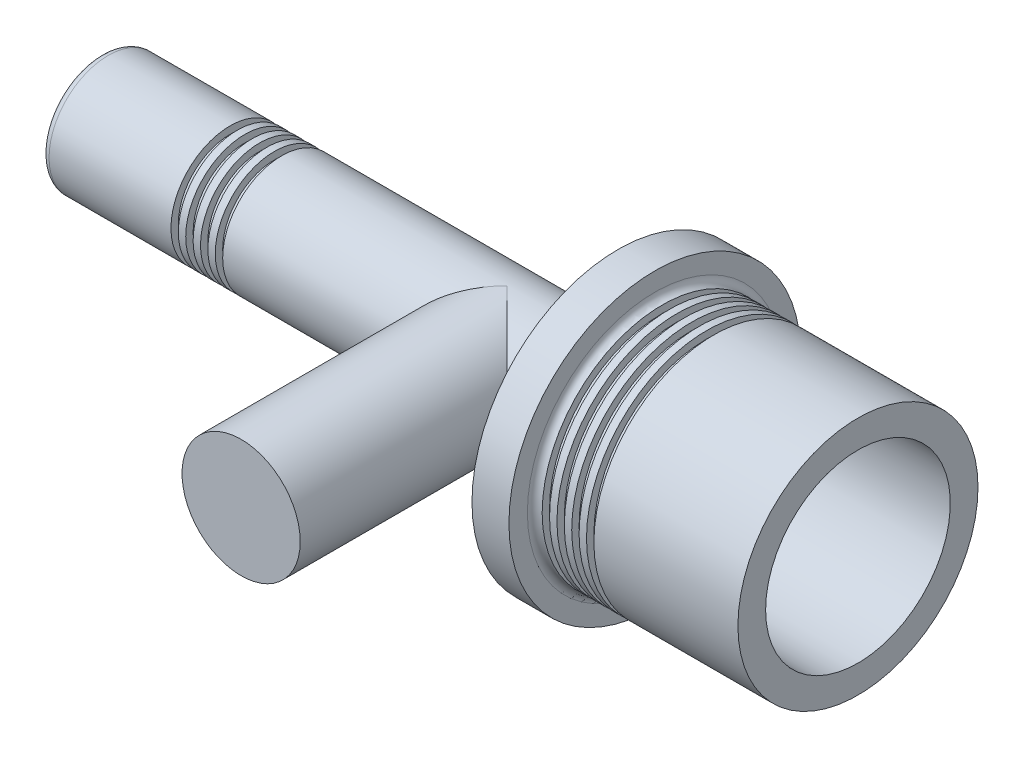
ISO-10303-21;
HEADER;
FILE_DESCRIPTION(('STEP AP214'),'2;1');
FILE_NAME('part.step','',(''),(''),'','','');
FILE_SCHEMA(('AUTOMOTIVE_DESIGN { 1 0 10303 214 1 1 1 1 }'));
ENDSEC;
DATA;
#1=APPLICATION_CONTEXT('core data for automotive mechanical design processes');
#2=APPLICATION_PROTOCOL_DEFINITION('international standard','automotive_design',2000,#1);
#3=PRODUCT_CONTEXT('',#1,'mechanical');
#4=PRODUCT('Part','Part','',(#3));
#5=PRODUCT_RELATED_PRODUCT_CATEGORY('part','',(#4));
#6=PRODUCT_DEFINITION_FORMATION('','',#4);
#7=PRODUCT_DEFINITION_CONTEXT('part definition',#1,'design');
#8=PRODUCT_DEFINITION('design','',#6,#7);
#9=PRODUCT_DEFINITION_SHAPE('','',#8);
#10=(LENGTH_UNIT() NAMED_UNIT(*) SI_UNIT(.MILLI.,.METRE.));
#11=(NAMED_UNIT(*) PLANE_ANGLE_UNIT() SI_UNIT($,.RADIAN.));
#12=(NAMED_UNIT(*) SI_UNIT($,.STERADIAN.) SOLID_ANGLE_UNIT());
#13=UNCERTAINTY_MEASURE_WITH_UNIT(LENGTH_MEASURE(1.E-05),#10,'distance_accuracy_value','');
#14=(GEOMETRIC_REPRESENTATION_CONTEXT(3) GLOBAL_UNCERTAINTY_ASSIGNED_CONTEXT((#13)) GLOBAL_UNIT_ASSIGNED_CONTEXT((#10,
#11,#12)) REPRESENTATION_CONTEXT('',''));
#15=CARTESIAN_POINT('',(0.,0.,0.));
#16=DIRECTION('',(0.,0.,1.));
#17=DIRECTION('',(1.,0.,0.));
#18=AXIS2_PLACEMENT_3D('',#15,#16,#17);
#19=CARTESIAN_POINT('',(0.,0.,0.));
#20=DIRECTION('',(-1.,0.,0.));
#21=DIRECTION('',(0.,0.,1.));
#22=AXIS2_PLACEMENT_3D('',#19,#20,#21);
#23=CYLINDRICAL_SURFACE('',#22,1.6);
#24=CARTESIAN_POINT('',(14.0001,0.,0.));
#25=DIRECTION('',(-1.,0.,0.));
#26=DIRECTION('',(0.,0.,1.));
#27=AXIS2_PLACEMENT_3D('',#24,#25,#26);
#28=CIRCLE('',#27,1.6);
#29=CARTESIAN_POINT('',(14.0001,0.,1.6));
#30=VERTEX_POINT('',#29);
#31=EDGE_CURVE('E195',#30,#30,#28,.T.);
#32=ORIENTED_EDGE('',*,*,#31,.T.);
#33=EDGE_LOOP('',(#32));
#34=FACE_BOUND('',#33,.T.);
#35=CARTESIAN_POINT('',(4.9001,0.,0.));
#36=DIRECTION('',(-1.,0.,0.));
#37=DIRECTION('',(0.,0.,1.));
#38=AXIS2_PLACEMENT_3D('',#35,#36,#37);
#39=CIRCLE('',#38,1.6);
#40=CARTESIAN_POINT('',(4.9001,0.,1.6));
#41=VERTEX_POINT('',#40);
#42=EDGE_CURVE('E192',#41,#41,#39,.T.);
#43=ORIENTED_EDGE('',*,*,#42,.F.);
#44=EDGE_LOOP('',(#43));
#45=FACE_BOUND('',#44,.T.);
#46=CARTESIAN_POINT('',(11.0001,0.,0.));
#47=DIRECTION('',(-0.707106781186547,0.,-0.707106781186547));
#48=DIRECTION('',(-0.707106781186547,0.,0.707106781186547));
#49=AXIS2_PLACEMENT_3D('',#46,#47,#48);
#50=ELLIPSE('',#49,2.26274169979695,1.6);
#51=CARTESIAN_POINT('',(11.0001,1.6,0.));
#52=VERTEX_POINT('',#51);
#53=CARTESIAN_POINT('',(11.0001,-1.6,0.));
#54=VERTEX_POINT('',#53);
#55=EDGE_CURVE('E42',#52,#54,#50,.F.);
#56=ORIENTED_EDGE('',*,*,#55,.F.);
#57=CARTESIAN_POINT('',(11.0001,0.,0.));
#58=DIRECTION('',(-0.707106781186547,0.,0.707106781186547));
#59=DIRECTION('',(-0.707106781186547,0.,-0.707106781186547));
#60=AXIS2_PLACEMENT_3D('',#57,#58,#59);
#61=ELLIPSE('',#60,2.26274169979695,1.6);
#62=EDGE_CURVE('E40',#54,#52,#61,.T.);
#63=ORIENTED_EDGE('',*,*,#62,.F.);
#64=EDGE_LOOP('',(#56,#63));
#65=FACE_BOUND('',#64,.T.);
#66=ADVANCED_FACE('F26',(#34,#45,#65),#23,.T.);
#67=CARTESIAN_POINT('',(9.99999999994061E-05,0.,0.));
#68=DIRECTION('',(1.,0.,0.));
#69=DIRECTION('',(0.,0.,-1.));
#70=AXIS2_PLACEMENT_3D('',#67,#68,#69);
#71=PLANE('',#70);
#72=CARTESIAN_POINT('',(9.99999999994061E-05,0.,0.));
#73=DIRECTION('',(1.,0.,0.));
#74=DIRECTION('',(0.,0.,-1.));
#75=AXIS2_PLACEMENT_3D('',#72,#73,#74);
#76=CIRCLE('',#75,1.4);
#77=CARTESIAN_POINT('',(9.99999999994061E-05,0.,-1.4));
#78=VERTEX_POINT('',#77);
#79=EDGE_CURVE('E44',#78,#78,#76,.F.);
#80=ORIENTED_EDGE('',*,*,#79,.T.);
#81=EDGE_LOOP('',(#80));
#82=FACE_BOUND('',#81,.T.);
#83=ADVANCED_FACE('F28',(#82),#71,.F.);
#84=CARTESIAN_POINT('',(0.,0.,0.));
#85=DIRECTION('',(-1.,0.,0.));
#86=DIRECTION('',(0.,0.,1.));
#87=AXIS2_PLACEMENT_3D('',#84,#85,#86);
#88=CYLINDRICAL_SURFACE('',#87,1.6);
#89=CARTESIAN_POINT('',(0.200099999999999,0.,0.));
#90=DIRECTION('',(1.,0.,0.));
#91=DIRECTION('',(0.,0.,-1.));
#92=AXIS2_PLACEMENT_3D('',#89,#90,#91);
#93=CIRCLE('',#92,1.6);
#94=CARTESIAN_POINT('',(0.200099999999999,0.,-1.6));
#95=VERTEX_POINT('',#94);
#96=EDGE_CURVE('E34',#95,#95,#93,.T.);
#97=ORIENTED_EDGE('',*,*,#96,.T.);
#98=EDGE_LOOP('',(#97));
#99=FACE_BOUND('',#98,.T.);
#100=CARTESIAN_POINT('',(3.5001,0.,0.));
#101=DIRECTION('',(-1.,0.,0.));
#102=DIRECTION('',(0.,0.,1.));
#103=AXIS2_PLACEMENT_3D('',#100,#101,#102);
#104=CIRCLE('',#103,1.6);
#105=CARTESIAN_POINT('',(3.5001,0.,1.6));
#106=VERTEX_POINT('',#105);
#107=EDGE_CURVE('E47',#106,#106,#104,.T.);
#108=ORIENTED_EDGE('',*,*,#107,.T.);
#109=EDGE_LOOP('',(#108));
#110=FACE_BOUND('',#109,.T.);
#111=ADVANCED_FACE('F58',(#99,#110),#88,.T.);
#112=CARTESIAN_POINT('',(3.5001,1.6,0.));
#113=DIRECTION('',(-1.,0.,0.));
#114=DIRECTION('',(0.,0.,1.));
#115=AXIS2_PLACEMENT_3D('',#112,#113,#114);
#116=PLANE('',#115);
#117=ORIENTED_EDGE('',*,*,#107,.F.);
#118=EDGE_LOOP('',(#117));
#119=FACE_BOUND('',#118,.T.);
#120=CARTESIAN_POINT('',(3.5001,0.,0.));
#121=DIRECTION('',(-1.,0.,0.));
#122=DIRECTION('',(0.,0.,1.));
#123=AXIS2_PLACEMENT_3D('',#120,#121,#122);
#124=CIRCLE('',#123,1.4);
#125=CARTESIAN_POINT('',(3.5001,0.,1.4));
#126=VERTEX_POINT('',#125);
#127=EDGE_CURVE('E50',#126,#126,#124,.T.);
#128=ORIENTED_EDGE('',*,*,#127,.T.);
#129=EDGE_LOOP('',(#128));
#130=FACE_BOUND('',#129,.T.);
#131=ADVANCED_FACE('F74',(#119,#130),#116,.F.);
#132=CARTESIAN_POINT('',(0.,0.,0.));
#133=DIRECTION('',(-1.,0.,0.));
#134=DIRECTION('',(0.,0.,1.));
#135=AXIS2_PLACEMENT_3D('',#132,#133,#134);
#136=CYLINDRICAL_SURFACE('',#135,1.4);
#137=ORIENTED_EDGE('',*,*,#127,.F.);
#138=EDGE_LOOP('',(#137));
#139=FACE_BOUND('',#138,.T.);
#140=CARTESIAN_POINT('',(3.7001,0.,0.));
#141=DIRECTION('',(-1.,0.,0.));
#142=DIRECTION('',(0.,0.,1.));
#143=AXIS2_PLACEMENT_3D('',#140,#141,#142);
#144=CIRCLE('',#143,1.4);
#145=CARTESIAN_POINT('',(3.7001,0.,1.4));
#146=VERTEX_POINT('',#145);
#147=EDGE_CURVE('E152',#146,#146,#144,.T.);
#148=ORIENTED_EDGE('',*,*,#147,.T.);
#149=EDGE_LOOP('',(#148));
#150=FACE_BOUND('',#149,.T.);
#151=ADVANCED_FACE('F139',(#139,#150),#136,.T.);
#152=CARTESIAN_POINT('',(3.7001,1.4,0.));
#153=DIRECTION('',(1.,0.,0.));
#154=DIRECTION('',(0.,0.,-1.));
#155=AXIS2_PLACEMENT_3D('',#152,#153,#154);
#156=PLANE('',#155);
#157=ORIENTED_EDGE('',*,*,#147,.F.);
#158=EDGE_LOOP('',(#157));
#159=FACE_BOUND('',#158,.T.);
#160=CARTESIAN_POINT('',(3.7001,0.,0.));
#161=DIRECTION('',(-1.,0.,0.));
#162=DIRECTION('',(0.,0.,1.));
#163=AXIS2_PLACEMENT_3D('',#160,#161,#162);
#164=CIRCLE('',#163,1.6);
#165=CARTESIAN_POINT('',(3.7001,0.,1.6));
#166=VERTEX_POINT('',#165);
#167=EDGE_CURVE('E154',#166,#166,#164,.T.);
#168=ORIENTED_EDGE('',*,*,#167,.T.);
#169=EDGE_LOOP('',(#168));
#170=FACE_BOUND('',#169,.T.);
#171=ADVANCED_FACE('F135',(#159,#170),#156,.F.);
#172=CARTESIAN_POINT('',(0.,0.,0.));
#173=DIRECTION('',(-1.,0.,0.));
#174=DIRECTION('',(0.,0.,1.));
#175=AXIS2_PLACEMENT_3D('',#172,#173,#174);
#176=CYLINDRICAL_SURFACE('',#175,1.6);
#177=ORIENTED_EDGE('',*,*,#167,.F.);
#178=EDGE_LOOP('',(#177));
#179=FACE_BOUND('',#178,.T.);
#180=CARTESIAN_POINT('',(3.9001,0.,0.));
#181=DIRECTION('',(-1.,0.,0.));
#182=DIRECTION('',(0.,0.,1.));
#183=AXIS2_PLACEMENT_3D('',#180,#181,#182);
#184=CIRCLE('',#183,1.6);
#185=CARTESIAN_POINT('',(3.9001,0.,1.6));
#186=VERTEX_POINT('',#185);
#187=EDGE_CURVE('E159',#186,#186,#184,.T.);
#188=ORIENTED_EDGE('',*,*,#187,.T.);
#189=EDGE_LOOP('',(#188));
#190=FACE_BOUND('',#189,.T.);
#191=ADVANCED_FACE('F131',(#179,#190),#176,.T.);
#192=CARTESIAN_POINT('',(3.9001,1.6,0.));
#193=DIRECTION('',(-1.,0.,0.));
#194=DIRECTION('',(0.,0.,1.));
#195=AXIS2_PLACEMENT_3D('',#192,#193,#194);
#196=PLANE('',#195);
#197=ORIENTED_EDGE('',*,*,#187,.F.);
#198=EDGE_LOOP('',(#197));
#199=FACE_BOUND('',#198,.T.);
#200=CARTESIAN_POINT('',(3.9001,0.,0.));
#201=DIRECTION('',(-1.,0.,0.));
#202=DIRECTION('',(0.,0.,1.));
#203=AXIS2_PLACEMENT_3D('',#200,#201,#202);
#204=CIRCLE('',#203,1.4);
#205=CARTESIAN_POINT('',(3.9001,0.,1.4));
#206=VERTEX_POINT('',#205);
#207=EDGE_CURVE('E162',#206,#206,#204,.T.);
#208=ORIENTED_EDGE('',*,*,#207,.T.);
#209=EDGE_LOOP('',(#208));
#210=FACE_BOUND('',#209,.T.);
#211=ADVANCED_FACE('F127',(#199,#210),#196,.F.);
#212=CARTESIAN_POINT('',(0.,0.,0.));
#213=DIRECTION('',(-1.,0.,0.));
#214=DIRECTION('',(0.,0.,1.));
#215=AXIS2_PLACEMENT_3D('',#212,#213,#214);
#216=CYLINDRICAL_SURFACE('',#215,1.4);
#217=ORIENTED_EDGE('',*,*,#207,.F.);
#218=EDGE_LOOP('',(#217));
#219=FACE_BOUND('',#218,.T.);
#220=CARTESIAN_POINT('',(4.1001,0.,0.));
#221=DIRECTION('',(-1.,0.,0.));
#222=DIRECTION('',(0.,0.,1.));
#223=AXIS2_PLACEMENT_3D('',#220,#221,#222);
#224=CIRCLE('',#223,1.4);
#225=CARTESIAN_POINT('',(4.1001,0.,1.4));
#226=VERTEX_POINT('',#225);
#227=EDGE_CURVE('E165',#226,#226,#224,.T.);
#228=ORIENTED_EDGE('',*,*,#227,.T.);
#229=EDGE_LOOP('',(#228));
#230=FACE_BOUND('',#229,.T.);
#231=ADVANCED_FACE('F123',(#219,#230),#216,.T.);
#232=CARTESIAN_POINT('',(4.1001,1.4,0.));
#233=DIRECTION('',(1.,0.,0.));
#234=DIRECTION('',(0.,0.,-1.));
#235=AXIS2_PLACEMENT_3D('',#232,#233,#234);
#236=PLANE('',#235);
#237=ORIENTED_EDGE('',*,*,#227,.F.);
#238=EDGE_LOOP('',(#237));
#239=FACE_BOUND('',#238,.T.);
#240=CARTESIAN_POINT('',(4.1001,0.,0.));
#241=DIRECTION('',(-1.,0.,0.));
#242=DIRECTION('',(0.,0.,1.));
#243=AXIS2_PLACEMENT_3D('',#240,#241,#242);
#244=CIRCLE('',#243,1.6);
#245=CARTESIAN_POINT('',(4.1001,0.,1.6));
#246=VERTEX_POINT('',#245);
#247=EDGE_CURVE('E168',#246,#246,#244,.T.);
#248=ORIENTED_EDGE('',*,*,#247,.T.);
#249=EDGE_LOOP('',(#248));
#250=FACE_BOUND('',#249,.T.);
#251=ADVANCED_FACE('F119',(#239,#250),#236,.F.);
#252=CARTESIAN_POINT('',(0.,0.,0.));
#253=DIRECTION('',(-1.,0.,0.));
#254=DIRECTION('',(0.,0.,1.));
#255=AXIS2_PLACEMENT_3D('',#252,#253,#254);
#256=CYLINDRICAL_SURFACE('',#255,1.6);
#257=ORIENTED_EDGE('',*,*,#247,.F.);
#258=EDGE_LOOP('',(#257));
#259=FACE_BOUND('',#258,.T.);
#260=CARTESIAN_POINT('',(4.3001,0.,0.));
#261=DIRECTION('',(-1.,0.,0.));
#262=DIRECTION('',(0.,0.,1.));
#263=AXIS2_PLACEMENT_3D('',#260,#261,#262);
#264=CIRCLE('',#263,1.6);
#265=CARTESIAN_POINT('',(4.3001,0.,1.6));
#266=VERTEX_POINT('',#265);
#267=EDGE_CURVE('E171',#266,#266,#264,.T.);
#268=ORIENTED_EDGE('',*,*,#267,.T.);
#269=EDGE_LOOP('',(#268));
#270=FACE_BOUND('',#269,.T.);
#271=ADVANCED_FACE('F115',(#259,#270),#256,.T.);
#272=CARTESIAN_POINT('',(4.3001,1.6,0.));
#273=DIRECTION('',(-1.,0.,0.));
#274=DIRECTION('',(0.,0.,1.));
#275=AXIS2_PLACEMENT_3D('',#272,#273,#274);
#276=PLANE('',#275);
#277=ORIENTED_EDGE('',*,*,#267,.F.);
#278=EDGE_LOOP('',(#277));
#279=FACE_BOUND('',#278,.T.);
#280=CARTESIAN_POINT('',(4.3001,0.,0.));
#281=DIRECTION('',(-1.,0.,0.));
#282=DIRECTION('',(0.,0.,1.));
#283=AXIS2_PLACEMENT_3D('',#280,#281,#282);
#284=CIRCLE('',#283,1.4);
#285=CARTESIAN_POINT('',(4.3001,0.,1.4));
#286=VERTEX_POINT('',#285);
#287=EDGE_CURVE('E174',#286,#286,#284,.T.);
#288=ORIENTED_EDGE('',*,*,#287,.T.);
#289=EDGE_LOOP('',(#288));
#290=FACE_BOUND('',#289,.T.);
#291=ADVANCED_FACE('F111',(#279,#290),#276,.F.);
#292=CARTESIAN_POINT('',(0.,0.,0.));
#293=DIRECTION('',(-1.,0.,0.));
#294=DIRECTION('',(0.,0.,1.));
#295=AXIS2_PLACEMENT_3D('',#292,#293,#294);
#296=CYLINDRICAL_SURFACE('',#295,1.4);
#297=ORIENTED_EDGE('',*,*,#287,.F.);
#298=EDGE_LOOP('',(#297));
#299=FACE_BOUND('',#298,.T.);
#300=CARTESIAN_POINT('',(4.5001,0.,0.));
#301=DIRECTION('',(-1.,0.,0.));
#302=DIRECTION('',(0.,0.,1.));
#303=AXIS2_PLACEMENT_3D('',#300,#301,#302);
#304=CIRCLE('',#303,1.4);
#305=CARTESIAN_POINT('',(4.5001,0.,1.4));
#306=VERTEX_POINT('',#305);
#307=EDGE_CURVE('E177',#306,#306,#304,.T.);
#308=ORIENTED_EDGE('',*,*,#307,.T.);
#309=EDGE_LOOP('',(#308));
#310=FACE_BOUND('',#309,.T.);
#311=ADVANCED_FACE('F107',(#299,#310),#296,.T.);
#312=CARTESIAN_POINT('',(4.5001,1.6,0.));
#313=DIRECTION('',(1.,0.,0.));
#314=DIRECTION('',(0.,0.,-1.));
#315=AXIS2_PLACEMENT_3D('',#312,#313,#314);
#316=PLANE('',#315);
#317=ORIENTED_EDGE('',*,*,#307,.F.);
#318=EDGE_LOOP('',(#317));
#319=FACE_BOUND('',#318,.T.);
#320=CARTESIAN_POINT('',(4.5001,0.,0.));
#321=DIRECTION('',(-1.,0.,0.));
#322=DIRECTION('',(0.,0.,1.));
#323=AXIS2_PLACEMENT_3D('',#320,#321,#322);
#324=CIRCLE('',#323,1.6);
#325=CARTESIAN_POINT('',(4.5001,0.,1.6));
#326=VERTEX_POINT('',#325);
#327=EDGE_CURVE('E180',#326,#326,#324,.T.);
#328=ORIENTED_EDGE('',*,*,#327,.T.);
#329=EDGE_LOOP('',(#328));
#330=FACE_BOUND('',#329,.T.);
#331=ADVANCED_FACE('F103',(#319,#330),#316,.F.);
#332=CARTESIAN_POINT('',(0.,0.,0.));
#333=DIRECTION('',(-1.,0.,0.));
#334=DIRECTION('',(0.,0.,1.));
#335=AXIS2_PLACEMENT_3D('',#332,#333,#334);
#336=CYLINDRICAL_SURFACE('',#335,1.6);
#337=ORIENTED_EDGE('',*,*,#327,.F.);
#338=EDGE_LOOP('',(#337));
#339=FACE_BOUND('',#338,.T.);
#340=CARTESIAN_POINT('',(4.7001,0.,0.));
#341=DIRECTION('',(-1.,0.,0.));
#342=DIRECTION('',(0.,0.,1.));
#343=AXIS2_PLACEMENT_3D('',#340,#341,#342);
#344=CIRCLE('',#343,1.6);
#345=CARTESIAN_POINT('',(4.7001,0.,1.6));
#346=VERTEX_POINT('',#345);
#347=EDGE_CURVE('E183',#346,#346,#344,.T.);
#348=ORIENTED_EDGE('',*,*,#347,.T.);
#349=EDGE_LOOP('',(#348));
#350=FACE_BOUND('',#349,.T.);
#351=ADVANCED_FACE('F99',(#339,#350),#336,.T.);
#352=CARTESIAN_POINT('',(4.7001,1.6,0.));
#353=DIRECTION('',(-1.,0.,0.));
#354=DIRECTION('',(0.,0.,1.));
#355=AXIS2_PLACEMENT_3D('',#352,#353,#354);
#356=PLANE('',#355);
#357=ORIENTED_EDGE('',*,*,#347,.F.);
#358=EDGE_LOOP('',(#357));
#359=FACE_BOUND('',#358,.T.);
#360=CARTESIAN_POINT('',(4.7001,0.,0.));
#361=DIRECTION('',(-1.,0.,0.));
#362=DIRECTION('',(0.,0.,1.));
#363=AXIS2_PLACEMENT_3D('',#360,#361,#362);
#364=CIRCLE('',#363,1.4);
#365=CARTESIAN_POINT('',(4.7001,0.,1.4));
#366=VERTEX_POINT('',#365);
#367=EDGE_CURVE('E186',#366,#366,#364,.T.);
#368=ORIENTED_EDGE('',*,*,#367,.T.);
#369=EDGE_LOOP('',(#368));
#370=FACE_BOUND('',#369,.T.);
#371=ADVANCED_FACE('F95',(#359,#370),#356,.F.);
#372=CARTESIAN_POINT('',(0.,0.,0.));
#373=DIRECTION('',(-1.,0.,0.));
#374=DIRECTION('',(0.,0.,1.));
#375=AXIS2_PLACEMENT_3D('',#372,#373,#374);
#376=CYLINDRICAL_SURFACE('',#375,1.4);
#377=ORIENTED_EDGE('',*,*,#367,.F.);
#378=EDGE_LOOP('',(#377));
#379=FACE_BOUND('',#378,.T.);
#380=CARTESIAN_POINT('',(4.9001,0.,0.));
#381=DIRECTION('',(-1.,0.,0.));
#382=DIRECTION('',(0.,0.,1.));
#383=AXIS2_PLACEMENT_3D('',#380,#381,#382);
#384=CIRCLE('',#383,1.4);
#385=CARTESIAN_POINT('',(4.9001,0.,1.4));
#386=VERTEX_POINT('',#385);
#387=EDGE_CURVE('E189',#386,#386,#384,.T.);
#388=ORIENTED_EDGE('',*,*,#387,.T.);
#389=EDGE_LOOP('',(#388));
#390=FACE_BOUND('',#389,.T.);
#391=ADVANCED_FACE('F91',(#379,#390),#376,.T.);
#392=CARTESIAN_POINT('',(4.9001,1.6,0.));
#393=DIRECTION('',(1.,0.,0.));
#394=DIRECTION('',(0.,0.,-1.));
#395=AXIS2_PLACEMENT_3D('',#392,#393,#394);
#396=PLANE('',#395);
#397=ORIENTED_EDGE('',*,*,#387,.F.);
#398=EDGE_LOOP('',(#397));
#399=FACE_BOUND('',#398,.T.);
#400=ORIENTED_EDGE('',*,*,#42,.T.);
#401=EDGE_LOOP('',(#400));
#402=FACE_BOUND('',#401,.T.);
#403=ADVANCED_FACE('F88',(#399,#402),#396,.F.);
#404=CARTESIAN_POINT('',(14.0001,1.6,0.));
#405=DIRECTION('',(1.,0.,0.));
#406=DIRECTION('',(0.,0.,-1.));
#407=AXIS2_PLACEMENT_3D('',#404,#405,#406);
#408=PLANE('',#407);
#409=ORIENTED_EDGE('',*,*,#31,.F.);
#410=EDGE_LOOP('',(#409));
#411=FACE_BOUND('',#410,.T.);
#412=CARTESIAN_POINT('',(14.0001,0.,0.));
#413=DIRECTION('',(-1.,0.,0.));
#414=DIRECTION('',(0.,0.,1.));
#415=AXIS2_PLACEMENT_3D('',#412,#413,#414);
#416=CIRCLE('',#415,3.95);
#417=CARTESIAN_POINT('',(14.0001,0.,3.95));
#418=VERTEX_POINT('',#417);
#419=EDGE_CURVE('E197',#418,#418,#416,.T.);
#420=ORIENTED_EDGE('',*,*,#419,.T.);
#421=EDGE_LOOP('',(#420));
#422=FACE_BOUND('',#421,.T.);
#423=ADVANCED_FACE('F86',(#411,#422),#408,.F.);
#424=CARTESIAN_POINT('',(0.,0.,0.));
#425=DIRECTION('',(-1.,0.,0.));
#426=DIRECTION('',(0.,0.,1.));
#427=AXIS2_PLACEMENT_3D('',#424,#425,#426);
#428=CYLINDRICAL_SURFACE('',#427,3.95);
#429=ORIENTED_EDGE('',*,*,#419,.F.);
#430=EDGE_LOOP('',(#429));
#431=FACE_BOUND('',#430,.T.);
#432=CARTESIAN_POINT('',(15.0001,0.,0.));
#433=DIRECTION('',(-1.,0.,0.));
#434=DIRECTION('',(0.,0.,1.));
#435=AXIS2_PLACEMENT_3D('',#432,#433,#434);
#436=CIRCLE('',#435,3.95);
#437=CARTESIAN_POINT('',(15.0001,0.,3.95));
#438=VERTEX_POINT('',#437);
#439=EDGE_CURVE('E200',#438,#438,#436,.T.);
#440=ORIENTED_EDGE('',*,*,#439,.T.);
#441=EDGE_LOOP('',(#440));
#442=FACE_BOUND('',#441,.T.);
#443=ADVANCED_FACE('F347',(#431,#442),#428,.T.);
#444=CARTESIAN_POINT('',(15.0001,3.95,0.));
#445=DIRECTION('',(-1.,0.,0.));
#446=DIRECTION('',(0.,0.,1.));
#447=AXIS2_PLACEMENT_3D('',#444,#445,#446);
#448=PLANE('',#447);
#449=CARTESIAN_POINT('',(15.0001,0.,0.));
#450=DIRECTION('',(-1.,0.,0.));
#451=DIRECTION('',(0.,0.,1.));
#452=AXIS2_PLACEMENT_3D('',#449,#450,#451);
#453=CIRCLE('',#452,3.45);
#454=CARTESIAN_POINT('',(15.0001,0.,3.45));
#455=VERTEX_POINT('',#454);
#456=EDGE_CURVE('E11',#455,#455,#453,.T.);
#457=ORIENTED_EDGE('',*,*,#456,.T.);
#458=EDGE_LOOP('',(#457));
#459=FACE_BOUND('',#458,.T.);
#460=ORIENTED_EDGE('',*,*,#439,.F.);
#461=EDGE_LOOP('',(#460));
#462=FACE_BOUND('',#461,.T.);
#463=ADVANCED_FACE('F344',(#459,#462),#448,.F.);
#464=CARTESIAN_POINT('',(15.2001,3.25,0.));
#465=DIRECTION('',(-1.,0.,0.));
#466=DIRECTION('',(0.,0.,1.));
#467=AXIS2_PLACEMENT_3D('',#464,#465,#466);
#468=PLANE('',#467);
#469=CARTESIAN_POINT('',(15.2001,0.,0.));
#470=DIRECTION('',(-1.,0.,0.));
#471=DIRECTION('',(0.,0.,1.));
#472=AXIS2_PLACEMENT_3D('',#469,#470,#471);
#473=CIRCLE('',#472,3.25);
#474=CARTESIAN_POINT('',(15.2001,0.,3.25));
#475=VERTEX_POINT('',#474);
#476=EDGE_CURVE('E203',#475,#475,#473,.T.);
#477=ORIENTED_EDGE('',*,*,#476,.F.);
#478=EDGE_LOOP('',(#477));
#479=FACE_BOUND('',#478,.T.);
#480=CARTESIAN_POINT('',(15.2001,0.,0.));
#481=DIRECTION('',(-1.,0.,0.));
#482=DIRECTION('',(0.,0.,1.));
#483=AXIS2_PLACEMENT_3D('',#480,#481,#482);
#484=CIRCLE('',#483,3.05);
#485=CARTESIAN_POINT('',(15.2001,0.,3.05));
#486=VERTEX_POINT('',#485);
#487=EDGE_CURVE('E206',#486,#486,#484,.T.);
#488=ORIENTED_EDGE('',*,*,#487,.T.);
#489=EDGE_LOOP('',(#488));
#490=FACE_BOUND('',#489,.T.);
#491=ADVANCED_FACE('F340',(#479,#490),#468,.F.);
#492=CARTESIAN_POINT('',(0.,0.,0.));
#493=DIRECTION('',(-1.,0.,0.));
#494=DIRECTION('',(0.,0.,1.));
#495=AXIS2_PLACEMENT_3D('',#492,#493,#494);
#496=CYLINDRICAL_SURFACE('',#495,3.05);
#497=ORIENTED_EDGE('',*,*,#487,.F.);
#498=EDGE_LOOP('',(#497));
#499=FACE_BOUND('',#498,.T.);
#500=CARTESIAN_POINT('',(15.4001,0.,0.));
#501=DIRECTION('',(-1.,0.,0.));
#502=DIRECTION('',(0.,0.,1.));
#503=AXIS2_PLACEMENT_3D('',#500,#501,#502);
#504=CIRCLE('',#503,3.05);
#505=CARTESIAN_POINT('',(15.4001,0.,3.05));
#506=VERTEX_POINT('',#505);
#507=EDGE_CURVE('E209',#506,#506,#504,.T.);
#508=ORIENTED_EDGE('',*,*,#507,.T.);
#509=EDGE_LOOP('',(#508));
#510=FACE_BOUND('',#509,.T.);
#511=ADVANCED_FACE('F336',(#499,#510),#496,.T.);
#512=CARTESIAN_POINT('',(15.4001,3.25,0.));
#513=DIRECTION('',(1.,0.,0.));
#514=DIRECTION('',(0.,0.,-1.));
#515=AXIS2_PLACEMENT_3D('',#512,#513,#514);
#516=PLANE('',#515);
#517=ORIENTED_EDGE('',*,*,#507,.F.);
#518=EDGE_LOOP('',(#517));
#519=FACE_BOUND('',#518,.T.);
#520=CARTESIAN_POINT('',(15.4001,0.,0.));
#521=DIRECTION('',(-1.,0.,0.));
#522=DIRECTION('',(0.,0.,1.));
#523=AXIS2_PLACEMENT_3D('',#520,#521,#522);
#524=CIRCLE('',#523,3.25);
#525=CARTESIAN_POINT('',(15.4001,0.,3.25));
#526=VERTEX_POINT('',#525);
#527=EDGE_CURVE('E212',#526,#526,#524,.T.);
#528=ORIENTED_EDGE('',*,*,#527,.T.);
#529=EDGE_LOOP('',(#528));
#530=FACE_BOUND('',#529,.T.);
#531=ADVANCED_FACE('F332',(#519,#530),#516,.F.);
#532=CARTESIAN_POINT('',(0.,0.,0.));
#533=DIRECTION('',(-1.,0.,0.));
#534=DIRECTION('',(0.,0.,1.));
#535=AXIS2_PLACEMENT_3D('',#532,#533,#534);
#536=CYLINDRICAL_SURFACE('',#535,3.25);
#537=ORIENTED_EDGE('',*,*,#527,.F.);
#538=EDGE_LOOP('',(#537));
#539=FACE_BOUND('',#538,.T.);
#540=CARTESIAN_POINT('',(15.6001,0.,0.));
#541=DIRECTION('',(-1.,0.,0.));
#542=DIRECTION('',(0.,0.,1.));
#543=AXIS2_PLACEMENT_3D('',#540,#541,#542);
#544=CIRCLE('',#543,3.25);
#545=CARTESIAN_POINT('',(15.6001,0.,3.25));
#546=VERTEX_POINT('',#545);
#547=EDGE_CURVE('E215',#546,#546,#544,.T.);
#548=ORIENTED_EDGE('',*,*,#547,.T.);
#549=EDGE_LOOP('',(#548));
#550=FACE_BOUND('',#549,.T.);
#551=ADVANCED_FACE('F328',(#539,#550),#536,.T.);
#552=CARTESIAN_POINT('',(15.6001,3.25,0.));
#553=DIRECTION('',(-1.,0.,0.));
#554=DIRECTION('',(0.,0.,1.));
#555=AXIS2_PLACEMENT_3D('',#552,#553,#554);
#556=PLANE('',#555);
#557=ORIENTED_EDGE('',*,*,#547,.F.);
#558=EDGE_LOOP('',(#557));
#559=FACE_BOUND('',#558,.T.);
#560=CARTESIAN_POINT('',(15.6001,0.,0.));
#561=DIRECTION('',(-1.,0.,0.));
#562=DIRECTION('',(0.,0.,1.));
#563=AXIS2_PLACEMENT_3D('',#560,#561,#562);
#564=CIRCLE('',#563,3.05);
#565=CARTESIAN_POINT('',(15.6001,0.,3.05));
#566=VERTEX_POINT('',#565);
#567=EDGE_CURVE('E218',#566,#566,#564,.T.);
#568=ORIENTED_EDGE('',*,*,#567,.T.);
#569=EDGE_LOOP('',(#568));
#570=FACE_BOUND('',#569,.T.);
#571=ADVANCED_FACE('F324',(#559,#570),#556,.F.);
#572=CARTESIAN_POINT('',(0.,0.,0.));
#573=DIRECTION('',(-1.,0.,0.));
#574=DIRECTION('',(0.,0.,1.));
#575=AXIS2_PLACEMENT_3D('',#572,#573,#574);
#576=CYLINDRICAL_SURFACE('',#575,3.05);
#577=ORIENTED_EDGE('',*,*,#567,.F.);
#578=EDGE_LOOP('',(#577));
#579=FACE_BOUND('',#578,.T.);
#580=CARTESIAN_POINT('',(15.8001,0.,0.));
#581=DIRECTION('',(-1.,0.,0.));
#582=DIRECTION('',(0.,0.,1.));
#583=AXIS2_PLACEMENT_3D('',#580,#581,#582);
#584=CIRCLE('',#583,3.05);
#585=CARTESIAN_POINT('',(15.8001,0.,3.05));
#586=VERTEX_POINT('',#585);
#587=EDGE_CURVE('E221',#586,#586,#584,.T.);
#588=ORIENTED_EDGE('',*,*,#587,.T.);
#589=EDGE_LOOP('',(#588));
#590=FACE_BOUND('',#589,.T.);
#591=ADVANCED_FACE('F320',(#579,#590),#576,.T.);
#592=CARTESIAN_POINT('',(15.8001,3.25,0.));
#593=DIRECTION('',(1.,0.,0.));
#594=DIRECTION('',(0.,0.,-1.));
#595=AXIS2_PLACEMENT_3D('',#592,#593,#594);
#596=PLANE('',#595);
#597=ORIENTED_EDGE('',*,*,#587,.F.);
#598=EDGE_LOOP('',(#597));
#599=FACE_BOUND('',#598,.T.);
#600=CARTESIAN_POINT('',(15.8001,0.,0.));
#601=DIRECTION('',(-1.,0.,0.));
#602=DIRECTION('',(0.,0.,1.));
#603=AXIS2_PLACEMENT_3D('',#600,#601,#602);
#604=CIRCLE('',#603,3.25);
#605=CARTESIAN_POINT('',(15.8001,0.,3.25));
#606=VERTEX_POINT('',#605);
#607=EDGE_CURVE('E224',#606,#606,#604,.T.);
#608=ORIENTED_EDGE('',*,*,#607,.T.);
#609=EDGE_LOOP('',(#608));
#610=FACE_BOUND('',#609,.T.);
#611=ADVANCED_FACE('F316',(#599,#610),#596,.F.);
#612=CARTESIAN_POINT('',(0.,0.,0.));
#613=DIRECTION('',(-1.,0.,0.));
#614=DIRECTION('',(0.,0.,1.));
#615=AXIS2_PLACEMENT_3D('',#612,#613,#614);
#616=CYLINDRICAL_SURFACE('',#615,3.25);
#617=ORIENTED_EDGE('',*,*,#607,.F.);
#618=EDGE_LOOP('',(#617));
#619=FACE_BOUND('',#618,.T.);
#620=CARTESIAN_POINT('',(16.0001,0.,0.));
#621=DIRECTION('',(-1.,0.,0.));
#622=DIRECTION('',(0.,0.,1.));
#623=AXIS2_PLACEMENT_3D('',#620,#621,#622);
#624=CIRCLE('',#623,3.25);
#625=CARTESIAN_POINT('',(16.0001,0.,3.25));
#626=VERTEX_POINT('',#625);
#627=EDGE_CURVE('E227',#626,#626,#624,.T.);
#628=ORIENTED_EDGE('',*,*,#627,.T.);
#629=EDGE_LOOP('',(#628));
#630=FACE_BOUND('',#629,.T.);
#631=ADVANCED_FACE('F312',(#619,#630),#616,.T.);
#632=CARTESIAN_POINT('',(16.0001,3.25,0.));
#633=DIRECTION('',(-1.,0.,0.));
#634=DIRECTION('',(0.,0.,1.));
#635=AXIS2_PLACEMENT_3D('',#632,#633,#634);
#636=PLANE('',#635);
#637=ORIENTED_EDGE('',*,*,#627,.F.);
#638=EDGE_LOOP('',(#637));
#639=FACE_BOUND('',#638,.T.);
#640=CARTESIAN_POINT('',(16.0001,0.,0.));
#641=DIRECTION('',(-1.,0.,0.));
#642=DIRECTION('',(0.,0.,1.));
#643=AXIS2_PLACEMENT_3D('',#640,#641,#642);
#644=CIRCLE('',#643,3.05);
#645=CARTESIAN_POINT('',(16.0001,0.,3.05));
#646=VERTEX_POINT('',#645);
#647=EDGE_CURVE('E230',#646,#646,#644,.T.);
#648=ORIENTED_EDGE('',*,*,#647,.T.);
#649=EDGE_LOOP('',(#648));
#650=FACE_BOUND('',#649,.T.);
#651=ADVANCED_FACE('F308',(#639,#650),#636,.F.);
#652=CARTESIAN_POINT('',(0.,0.,0.));
#653=DIRECTION('',(-1.,0.,0.));
#654=DIRECTION('',(0.,0.,1.));
#655=AXIS2_PLACEMENT_3D('',#652,#653,#654);
#656=CYLINDRICAL_SURFACE('',#655,3.05);
#657=ORIENTED_EDGE('',*,*,#647,.F.);
#658=EDGE_LOOP('',(#657));
#659=FACE_BOUND('',#658,.T.);
#660=CARTESIAN_POINT('',(16.2001,0.,0.));
#661=DIRECTION('',(-1.,0.,0.));
#662=DIRECTION('',(0.,0.,1.));
#663=AXIS2_PLACEMENT_3D('',#660,#661,#662);
#664=CIRCLE('',#663,3.05);
#665=CARTESIAN_POINT('',(16.2001,0.,3.05));
#666=VERTEX_POINT('',#665);
#667=EDGE_CURVE('E233',#666,#666,#664,.T.);
#668=ORIENTED_EDGE('',*,*,#667,.T.);
#669=EDGE_LOOP('',(#668));
#670=FACE_BOUND('',#669,.T.);
#671=ADVANCED_FACE('F304',(#659,#670),#656,.T.);
#672=CARTESIAN_POINT('',(16.2001,3.25,0.));
#673=DIRECTION('',(1.,0.,0.));
#674=DIRECTION('',(0.,0.,-1.));
#675=AXIS2_PLACEMENT_3D('',#672,#673,#674);
#676=PLANE('',#675);
#677=ORIENTED_EDGE('',*,*,#667,.F.);
#678=EDGE_LOOP('',(#677));
#679=FACE_BOUND('',#678,.T.);
#680=CARTESIAN_POINT('',(16.2001,0.,0.));
#681=DIRECTION('',(-1.,0.,0.));
#682=DIRECTION('',(0.,0.,1.));
#683=AXIS2_PLACEMENT_3D('',#680,#681,#682);
#684=CIRCLE('',#683,3.25);
#685=CARTESIAN_POINT('',(16.2001,0.,3.25));
#686=VERTEX_POINT('',#685);
#687=EDGE_CURVE('E236',#686,#686,#684,.T.);
#688=ORIENTED_EDGE('',*,*,#687,.T.);
#689=EDGE_LOOP('',(#688));
#690=FACE_BOUND('',#689,.T.);
#691=ADVANCED_FACE('F300',(#679,#690),#676,.F.);
#692=CARTESIAN_POINT('',(0.,0.,0.));
#693=DIRECTION('',(-1.,0.,0.));
#694=DIRECTION('',(0.,0.,1.));
#695=AXIS2_PLACEMENT_3D('',#692,#693,#694);
#696=CYLINDRICAL_SURFACE('',#695,3.25);
#697=ORIENTED_EDGE('',*,*,#687,.F.);
#698=EDGE_LOOP('',(#697));
#699=FACE_BOUND('',#698,.T.);
#700=CARTESIAN_POINT('',(16.4001,0.,0.));
#701=DIRECTION('',(-1.,0.,0.));
#702=DIRECTION('',(0.,0.,1.));
#703=AXIS2_PLACEMENT_3D('',#700,#701,#702);
#704=CIRCLE('',#703,3.25);
#705=CARTESIAN_POINT('',(16.4001,0.,3.25));
#706=VERTEX_POINT('',#705);
#707=EDGE_CURVE('E239',#706,#706,#704,.T.);
#708=ORIENTED_EDGE('',*,*,#707,.T.);
#709=EDGE_LOOP('',(#708));
#710=FACE_BOUND('',#709,.T.);
#711=ADVANCED_FACE('F296',(#699,#710),#696,.T.);
#712=CARTESIAN_POINT('',(16.4001,3.25,0.));
#713=DIRECTION('',(-1.,0.,0.));
#714=DIRECTION('',(0.,0.,1.));
#715=AXIS2_PLACEMENT_3D('',#712,#713,#714);
#716=PLANE('',#715);
#717=ORIENTED_EDGE('',*,*,#707,.F.);
#718=EDGE_LOOP('',(#717));
#719=FACE_BOUND('',#718,.T.);
#720=CARTESIAN_POINT('',(16.4001,0.,0.));
#721=DIRECTION('',(-1.,0.,0.));
#722=DIRECTION('',(0.,0.,1.));
#723=AXIS2_PLACEMENT_3D('',#720,#721,#722);
#724=CIRCLE('',#723,3.05);
#725=CARTESIAN_POINT('',(16.4001,0.,3.05));
#726=VERTEX_POINT('',#725);
#727=EDGE_CURVE('E242',#726,#726,#724,.T.);
#728=ORIENTED_EDGE('',*,*,#727,.T.);
#729=EDGE_LOOP('',(#728));
#730=FACE_BOUND('',#729,.T.);
#731=ADVANCED_FACE('F292',(#719,#730),#716,.F.);
#732=CARTESIAN_POINT('',(0.,0.,0.));
#733=DIRECTION('',(-1.,0.,0.));
#734=DIRECTION('',(0.,0.,1.));
#735=AXIS2_PLACEMENT_3D('',#732,#733,#734);
#736=CYLINDRICAL_SURFACE('',#735,3.05);
#737=ORIENTED_EDGE('',*,*,#727,.F.);
#738=EDGE_LOOP('',(#737));
#739=FACE_BOUND('',#738,.T.);
#740=CARTESIAN_POINT('',(16.6001,0.,0.));
#741=DIRECTION('',(-1.,0.,0.));
#742=DIRECTION('',(0.,0.,1.));
#743=AXIS2_PLACEMENT_3D('',#740,#741,#742);
#744=CIRCLE('',#743,3.05);
#745=CARTESIAN_POINT('',(16.6001,0.,3.05));
#746=VERTEX_POINT('',#745);
#747=EDGE_CURVE('E245',#746,#746,#744,.T.);
#748=ORIENTED_EDGE('',*,*,#747,.T.);
#749=EDGE_LOOP('',(#748));
#750=FACE_BOUND('',#749,.T.);
#751=ADVANCED_FACE('F288',(#739,#750),#736,.T.);
#752=CARTESIAN_POINT('',(16.6001,3.25,0.));
#753=DIRECTION('',(1.,0.,0.));
#754=DIRECTION('',(0.,0.,-1.));
#755=AXIS2_PLACEMENT_3D('',#752,#753,#754);
#756=PLANE('',#755);
#757=ORIENTED_EDGE('',*,*,#747,.F.);
#758=EDGE_LOOP('',(#757));
#759=FACE_BOUND('',#758,.T.);
#760=CARTESIAN_POINT('',(16.6001,0.,0.));
#761=DIRECTION('',(-1.,0.,0.));
#762=DIRECTION('',(0.,0.,1.));
#763=AXIS2_PLACEMENT_3D('',#760,#761,#762);
#764=CIRCLE('',#763,3.25);
#765=CARTESIAN_POINT('',(16.6001,0.,3.25));
#766=VERTEX_POINT('',#765);
#767=EDGE_CURVE('E248',#766,#766,#764,.T.);
#768=ORIENTED_EDGE('',*,*,#767,.T.);
#769=EDGE_LOOP('',(#768));
#770=FACE_BOUND('',#769,.T.);
#771=ADVANCED_FACE('F284',(#759,#770),#756,.F.);
#772=CARTESIAN_POINT('',(0.,0.,0.));
#773=DIRECTION('',(-1.,0.,0.));
#774=DIRECTION('',(0.,0.,1.));
#775=AXIS2_PLACEMENT_3D('',#772,#773,#774);
#776=CYLINDRICAL_SURFACE('',#775,3.25);
#777=ORIENTED_EDGE('',*,*,#767,.F.);
#778=EDGE_LOOP('',(#777));
#779=FACE_BOUND('',#778,.T.);
#780=CARTESIAN_POINT('',(20.5001,0.,0.));
#781=DIRECTION('',(-1.,0.,0.));
#782=DIRECTION('',(0.,0.,1.));
#783=AXIS2_PLACEMENT_3D('',#780,#781,#782);
#784=CIRCLE('',#783,3.25);
#785=CARTESIAN_POINT('',(20.5001,0.,3.25));
#786=VERTEX_POINT('',#785);
#787=EDGE_CURVE('E251',#786,#786,#784,.T.);
#788=ORIENTED_EDGE('',*,*,#787,.T.);
#789=EDGE_LOOP('',(#788));
#790=FACE_BOUND('',#789,.T.);
#791=ADVANCED_FACE('F280',(#779,#790),#776,.T.);
#792=CARTESIAN_POINT('',(20.5001,3.25,0.));
#793=DIRECTION('',(-1.,0.,0.));
#794=DIRECTION('',(0.,0.,1.));
#795=AXIS2_PLACEMENT_3D('',#792,#793,#794);
#796=PLANE('',#795);
#797=ORIENTED_EDGE('',*,*,#787,.F.);
#798=EDGE_LOOP('',(#797));
#799=FACE_BOUND('',#798,.T.);
#800=CARTESIAN_POINT('',(20.5001,0.,0.));
#801=DIRECTION('',(-1.,0.,0.));
#802=DIRECTION('',(0.,0.,1.));
#803=AXIS2_PLACEMENT_3D('',#800,#801,#802);
#804=CIRCLE('',#803,2.5);
#805=CARTESIAN_POINT('',(20.5001,0.,2.5));
#806=VERTEX_POINT('',#805);
#807=EDGE_CURVE('E254',#806,#806,#804,.T.);
#808=ORIENTED_EDGE('',*,*,#807,.T.);
#809=EDGE_LOOP('',(#808));
#810=FACE_BOUND('',#809,.T.);
#811=ADVANCED_FACE('F276',(#799,#810),#796,.F.);
#812=CARTESIAN_POINT('',(0.,0.,0.));
#813=DIRECTION('',(-1.,0.,0.));
#814=DIRECTION('',(0.,0.,1.));
#815=AXIS2_PLACEMENT_3D('',#812,#813,#814);
#816=CYLINDRICAL_SURFACE('',#815,2.5);
#817=ORIENTED_EDGE('',*,*,#807,.F.);
#818=EDGE_LOOP('',(#817));
#819=FACE_BOUND('',#818,.T.);
#820=CARTESIAN_POINT('',(15.2001,0.,0.));
#821=DIRECTION('',(-1.,0.,0.));
#822=DIRECTION('',(0.,0.,1.));
#823=AXIS2_PLACEMENT_3D('',#820,#821,#822);
#824=CIRCLE('',#823,2.5);
#825=CARTESIAN_POINT('',(15.2001,0.,2.5));
#826=VERTEX_POINT('',#825);
#827=EDGE_CURVE('E257',#826,#826,#824,.T.);
#828=ORIENTED_EDGE('',*,*,#827,.T.);
#829=EDGE_LOOP('',(#828));
#830=FACE_BOUND('',#829,.T.);
#831=ADVANCED_FACE('F270',(#819,#830),#816,.F.);
#832=CARTESIAN_POINT('',(15.2001,2.5,0.));
#833=DIRECTION('',(-1.,0.,0.));
#834=DIRECTION('',(0.,0.,1.));
#835=AXIS2_PLACEMENT_3D('',#832,#833,#834);
#836=PLANE('',#835);
#837=ORIENTED_EDGE('',*,*,#827,.F.);
#838=EDGE_LOOP('',(#837));
#839=FACE_BOUND('',#838,.T.);
#840=ADVANCED_FACE('F265',(#839),#836,.F.);
#841=CARTESIAN_POINT('',(11.0001,0.,7.2));
#842=DIRECTION('',(0.,0.,-1.));
#843=DIRECTION('',(-1.,0.,0.));
#844=AXIS2_PLACEMENT_3D('',#841,#842,#843);
#845=CYLINDRICAL_SURFACE('',#844,1.6);
#846=CARTESIAN_POINT('',(11.0001,0.,7.2));
#847=DIRECTION('',(0.,0.,1.));
#848=DIRECTION('',(1.,0.,0.));
#849=AXIS2_PLACEMENT_3D('',#846,#847,#848);
#850=CIRCLE('',#849,1.6);
#851=CARTESIAN_POINT('',(12.6001,0.,7.2));
#852=VERTEX_POINT('',#851);
#853=EDGE_CURVE('E260',#852,#852,#850,.T.);
#854=ORIENTED_EDGE('',*,*,#853,.F.);
#855=EDGE_LOOP('',(#854));
#856=FACE_BOUND('',#855,.T.);
#857=ORIENTED_EDGE('',*,*,#62,.T.);
#858=ORIENTED_EDGE('',*,*,#55,.T.);
#859=EDGE_LOOP('',(#857,#858));
#860=FACE_BOUND('',#859,.T.);
#861=ADVANCED_FACE('F46',(#856,#860),#845,.T.);
#862=CARTESIAN_POINT('',(11.0001,0.,7.2));
#863=DIRECTION('',(0.,0.,1.));
#864=DIRECTION('',(1.,0.,0.));
#865=AXIS2_PLACEMENT_3D('',#862,#863,#864);
#866=PLANE('',#865);
#867=ORIENTED_EDGE('',*,*,#853,.T.);
#868=EDGE_LOOP('',(#867));
#869=FACE_BOUND('',#868,.T.);
#870=ADVANCED_FACE('F65',(#869),#866,.T.);
#871=CARTESIAN_POINT('',(0.200099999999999,0.,0.));
#872=DIRECTION('',(1.,0.,0.));
#873=DIRECTION('',(0.,0.,-1.));
#874=AXIS2_PLACEMENT_3D('',#871,#872,#873);
#875=TOROIDAL_SURFACE('',#874,1.4,0.2);
#876=ORIENTED_EDGE('',*,*,#96,.F.);
#877=EDGE_LOOP('',(#876));
#878=FACE_BOUND('',#877,.T.);
#879=ORIENTED_EDGE('',*,*,#79,.F.);
#880=EDGE_LOOP('',(#879));
#881=FACE_BOUND('',#880,.T.);
#882=ADVANCED_FACE('F61',(#878,#881),#875,.T.);
#883=CARTESIAN_POINT('',(15.2001,0.,0.));
#884=DIRECTION('',(-1.,0.,0.));
#885=DIRECTION('',(0.,0.,1.));
#886=AXIS2_PLACEMENT_3D('',#883,#884,#885);
#887=TOROIDAL_SURFACE('',#886,3.45,0.2);
#888=ORIENTED_EDGE('',*,*,#476,.T.);
#889=EDGE_LOOP('',(#888));
#890=FACE_BOUND('',#889,.T.);
#891=ORIENTED_EDGE('',*,*,#456,.F.);
#892=EDGE_LOOP('',(#891));
#893=FACE_BOUND('',#892,.T.);
#894=ADVANCED_FACE('F64',(#890,#893),#887,.F.);
#895=CLOSED_SHELL('',(#66,#83,#111,#131,#151,#171,#191,#211,#231,#251,#271,#291,#311,#331,#351,
#371,#391,#403,#423,#443,#463,#491,#511,#531,#551,#571,#591,#611,#631,#651,#671,#691,#711,#731,
#751,#771,#791,#811,#831,#840,#861,#870,#882,#894));
#896=MANIFOLD_SOLID_BREP('B2',#895);
#897=ADVANCED_BREP_SHAPE_REPRESENTATION('',(#18,#896),#14);
#898=SHAPE_DEFINITION_REPRESENTATION(#9,#897);
ENDSEC;
END-ISO-10303-21;
